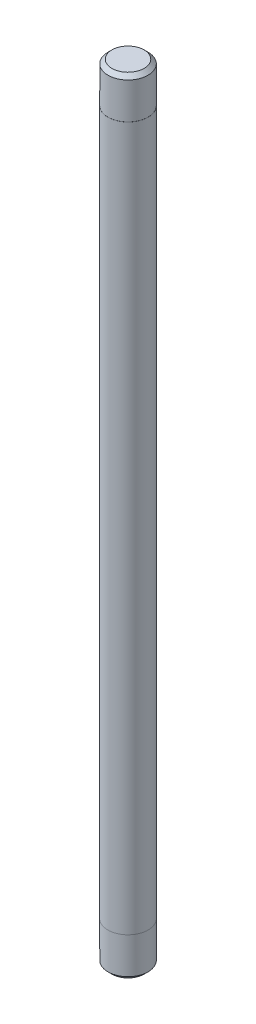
from build123d import *

# Parameters (mm, degrees)
SKETCH1_R          = 2
EXTRUDE1_DEPTH     = 78
CHAMFER1_SIZE      = 0.4
CHAMFER2_SIZE      = 0.4
CUT_EXTRUDE1_START = -4
SKETCH2_R          = 2
SKETCH2_R_2        = 1.99
CUT_EXTRUDE1_DEPTH = 4
SKETCH3_R          = 2
SKETCH3_R_2        = 1.99
CUT_EXTRUDE2_DEPTH = 4


with BuildPart() as part:
    # Sketch1 → Extrude1 (new body)
    with BuildSketch(Plane(origin=(0, 0, 0), x_dir=(1, 0, 0), z_dir=(0, 1, 0))):
        with Locations(Location((0, 0, 0), (0, 0, 270))):
            Circle(SKETCH1_R)
    extrude(amount=EXTRUDE1_DEPTH)

    # Chamfer1
    chamfer1_edges = [part.edges().sort_by_distance(p)[0] for p in [
        (0, 78, -2),
    ]]
    chamfer(chamfer1_edges, length=CHAMFER1_SIZE)

    # Chamfer2
    chamfer2_edges = [part.edges().sort_by_distance(p)[0] for p in [
        (0, 0, -2),
    ]]
    chamfer(chamfer2_edges, length=CHAMFER2_SIZE)

    # Sketch2 → Cut-Extrude1 (cut)
    with BuildSketch(Plane(origin=(0, 78, 0), x_dir=(-1, 0, 0), z_dir=(0, 1, 0)).offset(CUT_EXTRUDE1_START)):
        with Locations(Location((0, 0, 0), (0, 0, 90))):
            Circle(SKETCH2_R)
        with Locations(Location((0, 0, 0), (0, 0, 90))):
            Circle(SKETCH2_R_2, mode=Mode.SUBTRACT)
    extrude(amount=CUT_EXTRUDE1_DEPTH, mode=Mode.SUBTRACT)

    # Sketch3 → Cut-Extrude2 (cut)
    with BuildSketch(Plane.XZ):
        with Locations(Location((0, 0, 0), (0, 0, 270))):
            Circle(SKETCH3_R)
        with Locations(Location((0, 0, 0), (0, 0, 90))):
            Circle(SKETCH3_R_2, mode=Mode.SUBTRACT)
    extrude(amount=-CUT_EXTRUDE2_DEPTH, mode=Mode.SUBTRACT)


solid = part.part
